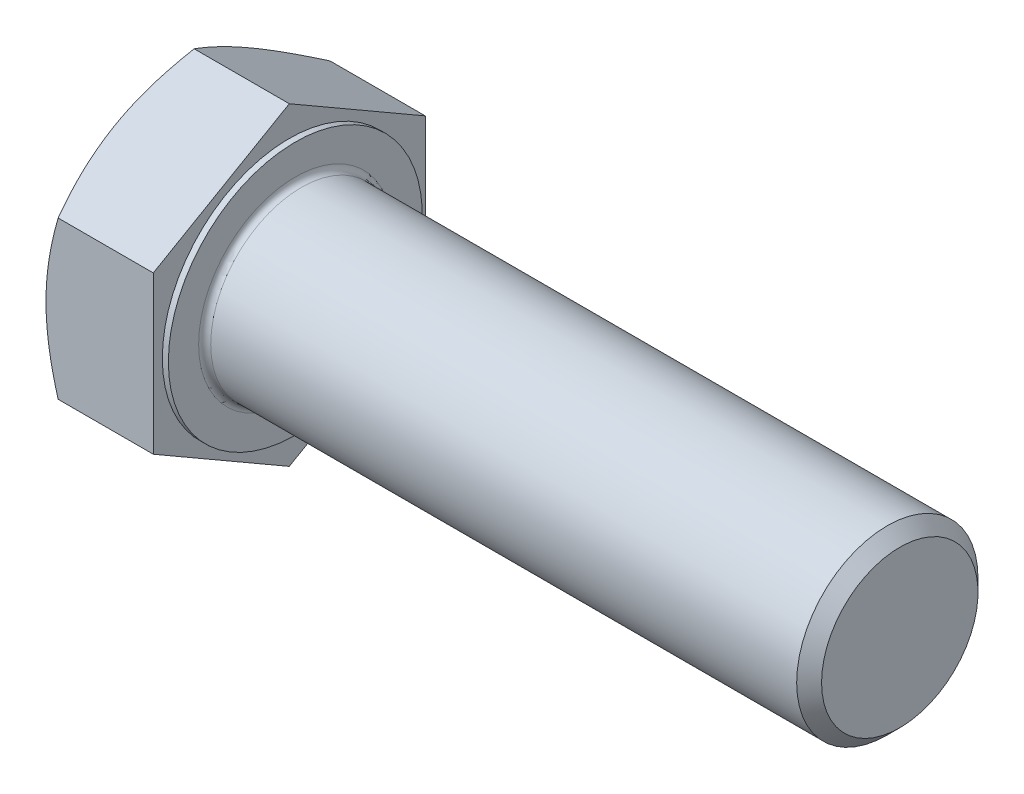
from build123d import *

# Parameters (mm, degrees)
BASEHEAD_DEPTH   = 15
BEARINGFACESKE_W = 0.8
BEARINGFACESKE_H = 3.979609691
FILLET_2_R       = 0.8


with BuildPart() as part:
    # BaseHeadSke → BaseHead (new body)
    with BuildSketch(Plane(origin=(0, 0, 0), x_dir=(0, 0, -1), z_dir=(1, 0, 0))):
        Polygon((18, 10.392304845), (0, 20.784609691), (-18, 10.392304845), (-18, -10.392304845), (0, -20.784609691), (18, -10.392304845), align=None)
    extrude(amount=BASEHEAD_DEPTH)

    # BodySke → BaseBody (revolve)
    with BuildSketch(Plane.XY, mode=Mode.PRIVATE) as basebody_sk:
        Polygon((0, 0), (95, 0), (95, 10.352), (93.352, 12), (0, 12), align=None)
    revolve(basebody_sk.sketch.rotate(Axis((0, 0, 0), (1, 0, 0)), 90), axis=Axis((0, 0, 0), (1, 0, 0)))

    # HeadChamferSke → HeadChamfer (revolve, cut)
    with BuildSketch(Plane.XY):
        Polygon((1.607695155, 20.784609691), (0, 20.784609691), (0, 18), align=None)
    revolve(axis=Axis((0, 0, 0), (1, 0, 0)), mode=Mode.SUBTRACT)

    # BearingFaceSke → BearingFace (revolve, cut)
    with BuildSketch(Plane.XY, mode=Mode.PRIVATE) as bearingface_sk:
        with Locations((14.6, 18.794804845)):
            Rectangle(BEARINGFACESKE_W, BEARINGFACESKE_H)
    revolve(bearingface_sk.sketch.rotate(Axis((0, 0, 0), (1, 0, 0)), 90), axis=Axis((0, 0, 0), (1, 0, 0)), mode=Mode.SUBTRACT)

    # Fillet 2
    fillet_2_edges = [part.edges().sort_by_distance(p)[0] for p in [
        (15, 0, -12),
    ]]
    fillet(fillet_2_edges, radius=FILLET_2_R)


solid = part.part
